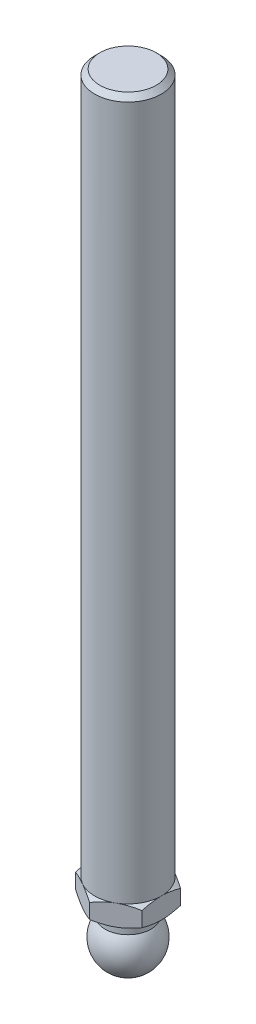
ISO-10303-21;
HEADER;
FILE_DESCRIPTION(('STEP AP214'),'2;1');
FILE_NAME('part.step','',(''),(''),'','','');
FILE_SCHEMA(('AUTOMOTIVE_DESIGN { 1 0 10303 214 1 1 1 1 }'));
ENDSEC;
DATA;
#1=APPLICATION_CONTEXT('core data for automotive mechanical design processes');
#2=APPLICATION_PROTOCOL_DEFINITION('international standard','automotive_design',2000,#1);
#3=PRODUCT_CONTEXT('',#1,'mechanical');
#4=PRODUCT('Part','Part','',(#3));
#5=PRODUCT_RELATED_PRODUCT_CATEGORY('part','',(#4));
#6=PRODUCT_DEFINITION_FORMATION('','',#4);
#7=PRODUCT_DEFINITION_CONTEXT('part definition',#1,'design');
#8=PRODUCT_DEFINITION('design','',#6,#7);
#9=PRODUCT_DEFINITION_SHAPE('','',#8);
#10=(LENGTH_UNIT() NAMED_UNIT(*) SI_UNIT(.MILLI.,.METRE.));
#11=(NAMED_UNIT(*) PLANE_ANGLE_UNIT() SI_UNIT($,.RADIAN.));
#12=(NAMED_UNIT(*) SI_UNIT($,.STERADIAN.) SOLID_ANGLE_UNIT());
#13=UNCERTAINTY_MEASURE_WITH_UNIT(LENGTH_MEASURE(1.E-05),#10,'distance_accuracy_value','');
#14=(GEOMETRIC_REPRESENTATION_CONTEXT(3) GLOBAL_UNCERTAINTY_ASSIGNED_CONTEXT((#13)) GLOBAL_UNIT_ASSIGNED_CONTEXT((#10,
#11,#12)) REPRESENTATION_CONTEXT('',''));
#15=CARTESIAN_POINT('',(0.,0.,0.));
#16=DIRECTION('',(0.,0.,1.));
#17=DIRECTION('',(1.,0.,0.));
#18=AXIS2_PLACEMENT_3D('',#15,#16,#17);
#19=CARTESIAN_POINT('',(0.,7.,0.));
#20=DIRECTION('',(0.,-1.,0.));
#21=DIRECTION('',(-1.,0.,0.));
#22=AXIS2_PLACEMENT_3D('',#19,#20,#21);
#23=SPHERICAL_SURFACE('',#22,7.);
#24=CARTESIAN_POINT('',(-9.71445146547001E-13,0.,0.));
#25=VERTEX_POINT('',#24);
#26=VERTEX_LOOP('',#25);
#27=FACE_BOUND('',#26,.T.);
#28=CARTESIAN_POINT('',(0.,11.3301270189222,0.));
#29=DIRECTION('',(0.,-1.,0.));
#30=DIRECTION('',(0.,0.,-1.));
#31=AXIS2_PLACEMENT_3D('',#28,#29,#30);
#32=CIRCLE('',#31,5.5);
#33=CARTESIAN_POINT('',(0.,11.3301270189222,-5.5));
#34=VERTEX_POINT('',#33);
#35=EDGE_CURVE('E10',#34,#34,#32,.T.);
#36=ORIENTED_EDGE('',*,*,#35,.T.);
#37=EDGE_LOOP('',(#36));
#38=FACE_BOUND('',#37,.T.);
#39=ADVANCED_FACE('F15',(#27,#38),#23,.T.);
#40=CARTESIAN_POINT('',(0.,0.,0.));
#41=DIRECTION('',(0.,-1.,0.));
#42=DIRECTION('',(0.,0.,-1.));
#43=AXIS2_PLACEMENT_3D('',#40,#41,#42);
#44=CYLINDRICAL_SURFACE('',#43,5.5);
#45=ORIENTED_EDGE('',*,*,#35,.F.);
#46=EDGE_LOOP('',(#45));
#47=FACE_BOUND('',#46,.T.);
#48=CARTESIAN_POINT('',(0.,14.5,0.));
#49=DIRECTION('',(0.,-1.,0.));
#50=DIRECTION('',(0.,0.,-1.));
#51=AXIS2_PLACEMENT_3D('',#48,#49,#50);
#52=CIRCLE('',#51,5.5);
#53=CARTESIAN_POINT('',(0.,14.5,-5.5));
#54=VERTEX_POINT('',#53);
#55=EDGE_CURVE('E147',#54,#54,#52,.T.);
#56=ORIENTED_EDGE('',*,*,#55,.T.);
#57=EDGE_LOOP('',(#56));
#58=FACE_BOUND('',#57,.T.);
#59=ADVANCED_FACE('F252',(#47,#58),#44,.T.);
#60=CARTESIAN_POINT('',(8.,14.5,0.));
#61=DIRECTION('',(0.,1.,0.));
#62=DIRECTION('',(0.,0.,1.));
#63=AXIS2_PLACEMENT_3D('',#60,#61,#62);
#64=PLANE('',#63);
#65=ORIENTED_EDGE('',*,*,#55,.F.);
#66=EDGE_LOOP('',(#65));
#67=FACE_BOUND('',#66,.T.);
#68=CARTESIAN_POINT('',(0.,14.5,0.));
#69=DIRECTION('',(0.,-1.,0.));
#70=DIRECTION('',(0.,0.,-1.));
#71=AXIS2_PLACEMENT_3D('',#68,#69,#70);
#72=CIRCLE('',#71,8.);
#73=CARTESIAN_POINT('',(4.,14.5,-6.92820323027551));
#74=VERTEX_POINT('',#73);
#75=CARTESIAN_POINT('',(8.,14.5,0.));
#76=VERTEX_POINT('',#75);
#77=EDGE_CURVE('E146',#74,#76,#72,.T.);
#78=ORIENTED_EDGE('',*,*,#77,.T.);
#79=CARTESIAN_POINT('',(4.,14.5,6.92820323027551));
#80=VERTEX_POINT('',#79);
#81=EDGE_CURVE('E142',#76,#80,#72,.T.);
#82=ORIENTED_EDGE('',*,*,#81,.T.);
#83=CARTESIAN_POINT('',(-4.,14.5,6.92820323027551));
#84=VERTEX_POINT('',#83);
#85=EDGE_CURVE('E145',#80,#84,#72,.T.);
#86=ORIENTED_EDGE('',*,*,#85,.T.);
#87=CARTESIAN_POINT('',(-8.,14.5,0.));
#88=VERTEX_POINT('',#87);
#89=EDGE_CURVE('E213',#84,#88,#72,.T.);
#90=ORIENTED_EDGE('',*,*,#89,.T.);
#91=CARTESIAN_POINT('',(-4.,14.5,-6.92820323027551));
#92=VERTEX_POINT('',#91);
#93=EDGE_CURVE('E216',#88,#92,#72,.T.);
#94=ORIENTED_EDGE('',*,*,#93,.T.);
#95=EDGE_CURVE('E221',#92,#74,#72,.T.);
#96=ORIENTED_EDGE('',*,*,#95,.T.);
#97=EDGE_LOOP('',(#78,#82,#86,#90,#94,#96));
#98=FACE_BOUND('',#97,.T.);
#99=ADVANCED_FACE('F223',(#67,#98),#64,.F.);
#100=CARTESIAN_POINT('',(0.,17.,0.));
#101=DIRECTION('',(0.,1.,0.));
#102=DIRECTION('',(0.,0.,1.));
#103=AXIS2_PLACEMENT_3D('',#100,#101,#102);
#104=CONICAL_SURFACE('',#103,12.3301270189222,1.0471975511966);
#105=CARTESIAN_POINT('',(-8.,19.285548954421,-14.1889203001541));
#106=CARTESIAN_POINT('',(-8.,19.1157216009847,-13.851186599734));
#107=CARTESIAN_POINT('',(-8.,18.9470198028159,-13.5128811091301));
#108=CARTESIAN_POINT('',(-8.,18.6124136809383,-12.8348638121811));
#109=CARTESIAN_POINT('',(-8.,18.446509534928,-12.4951519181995));
#110=CARTESIAN_POINT('',(-8.,18.1177477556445,-11.8134403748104));
#111=CARTESIAN_POINT('',(-8.,17.9548966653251,-11.4714375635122));
#112=CARTESIAN_POINT('',(-8.,17.6333333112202,-10.7854960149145));
#113=CARTESIAN_POINT('',(-8.,17.4746209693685,-10.4415573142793));
#114=CARTESIAN_POINT('',(-8.,17.1550497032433,-9.7353527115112));
#115=CARTESIAN_POINT('',(-8.,16.9944328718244,-9.37297690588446));
#116=CARTESIAN_POINT('',(-8.,16.680226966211,-8.64516064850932));
#117=CARTESIAN_POINT('',(-8.,16.5266382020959,-8.27972006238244));
#118=CARTESIAN_POINT('',(-8.,16.2285062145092,-7.54540420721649));
#119=CARTESIAN_POINT('',(-8.,16.0839575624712,-7.17653115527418));
#120=CARTESIAN_POINT('',(-8.,15.8063691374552,-6.43449862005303));
#121=CARTESIAN_POINT('',(-8.,15.6733281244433,-6.06133960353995));
#122=CARTESIAN_POINT('',(-8.,15.394180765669,-5.22677195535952));
#123=CARTESIAN_POINT('',(-8.,15.2517108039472,-4.7641292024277));
#124=CARTESIAN_POINT('',(-8.,14.9966536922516,-3.83044032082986));
#125=CARTESIAN_POINT('',(-8.,14.884064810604,-3.35939468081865));
#126=CARTESIAN_POINT('',(-8.,14.7453718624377,-2.65118427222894));
#127=CARTESIAN_POINT('',(-8.,14.7044045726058,-2.41690742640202));
#128=CARTESIAN_POINT('',(-8.,14.6329876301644,-1.94676929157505));
#129=CARTESIAN_POINT('',(-8.,14.6025364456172,-1.7109082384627));
#130=CARTESIAN_POINT('',(-8.,14.5530553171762,-1.23805721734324));
#131=CARTESIAN_POINT('',(-8.,14.5340217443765,-1.00106763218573));
#132=CARTESIAN_POINT('',(-8.,14.5079793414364,-0.52642336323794));
#133=CARTESIAN_POINT('',(-8.,14.500970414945,-0.288768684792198));
#134=CARTESIAN_POINT('',(-8.,14.4992116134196,0.188309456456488));
#135=CARTESIAN_POINT('',(-8.,14.5045509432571,0.427733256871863));
#136=CARTESIAN_POINT('',(-8.,14.5274871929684,0.905988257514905));
#137=CARTESIAN_POINT('',(-8.,14.5450842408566,1.1448194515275));
#138=CARTESIAN_POINT('',(-8.,14.5919591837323,1.62141631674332));
#139=CARTESIAN_POINT('',(-8.,14.6212415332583,1.85918154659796));
#140=CARTESIAN_POINT('',(-8.,14.6905925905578,2.33311174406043));
#141=CARTESIAN_POINT('',(-8.,14.7306614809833,2.56927668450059));
#142=CARTESIAN_POINT('',(-8.,14.8670437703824,3.28330816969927));
#143=CARTESIAN_POINT('',(-8.,14.9786420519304,3.75830022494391));
#144=CARTESIAN_POINT('',(-8.,15.169124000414,4.46428489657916));
#145=CARTESIAN_POINT('',(-8.,15.2364734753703,4.69855285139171));
#146=CARTESIAN_POINT('',(-8.,15.3778224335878,5.16507806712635));
#147=CARTESIAN_POINT('',(-8.,15.4518216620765,5.3973354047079));
#148=CARTESIAN_POINT('',(-8.,15.654376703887,6.0070580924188));
#149=CARTESIAN_POINT('',(-8.,15.7876997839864,6.38293491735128));
#150=CARTESIAN_POINT('',(-8.,16.0661205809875,7.13030495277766));
#151=CARTESIAN_POINT('',(-8.,16.2112196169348,7.50179766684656));
#152=CARTESIAN_POINT('',(-8.,16.5106611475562,8.2412884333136));
#153=CARTESIAN_POINT('',(-8.,16.6650093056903,8.60928418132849));
#154=CARTESIAN_POINT('',(-8.,16.9808780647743,9.34215095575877));
#155=CARTESIAN_POINT('',(-8.,17.1423983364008,9.7070221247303));
#156=CARTESIAN_POINT('',(-8.,17.4637771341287,10.4179250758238));
#157=CARTESIAN_POINT('',(-8.,17.6233869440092,10.7640696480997));
#158=CARTESIAN_POINT('',(-8.,17.9468132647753,11.4543922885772));
#159=CARTESIAN_POINT('',(-8.,18.1106298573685,11.7985703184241));
#160=CARTESIAN_POINT('',(-8.,18.441361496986,12.4845836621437));
#161=CARTESIAN_POINT('',(-8.,18.6082696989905,12.8264222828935));
#162=CARTESIAN_POINT('',(-8.,18.9449220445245,13.5086735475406));
#163=CARTESIAN_POINT('',(-8.,19.1146660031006,13.8490862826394));
#164=CARTESIAN_POINT('',(-8.,19.285548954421,14.1889203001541));
#165=B_SPLINE_CURVE_WITH_KNOTS('',3,(#105,#106,#107,#108,#109,#110,#111,#112,#113,#114,#115,
#116,#117,#118,#119,#120,#121,#122,#123,#124,#125,#126,#127,#128,#129,#130,#131,#132,#133,#134,
#135,#136,#137,#138,#139,#140,#141,#142,#143,#144,#145,#146,#147,#148,#149,#150,#151,#152,#153,
#154,#155,#156,#157,#158,#159,#160,#161,#162,#163,#164),.UNSPECIFIED.,.F.,.F.,(4,2,2,2,2,2,2,2,
2,2,2,2,2,2,2,2,2,2,2,2,2,2,2,2,2,2,2,2,2,4),(0.,1.13409047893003,2.2682527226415,
3.40461779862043,4.54096142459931,5.7300307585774,6.91915250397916,8.1075531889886,
9.29582565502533,10.7473798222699,12.1988498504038,12.9121466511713,13.6253394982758,
14.3383055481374,15.0512658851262,15.7693927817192,16.4875271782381,17.2059355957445,
17.9243561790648,19.3864869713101,20.1177019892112,20.8488890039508,22.0450800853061,
23.2414053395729,24.4384707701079,25.6354812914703,26.7789606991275,27.9224623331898,
29.063679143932,30.2048218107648),.UNSPECIFIED.);
#166=CARTESIAN_POINT('',(-8.,15.2145311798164,4.61880215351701));
#167=VERTEX_POINT('',#166);
#168=EDGE_CURVE('E158',#88,#167,#165,.T.);
#169=ORIENTED_EDGE('',*,*,#168,.F.);
#170=ORIENTED_EDGE('',*,*,#89,.F.);
#171=CARTESIAN_POINT('',(-8.0002,15.214597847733,4.61868668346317));
#172=CARTESIAN_POINT('',(-7.82435121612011,15.1559907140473,4.7202130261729));
#173=CARTESIAN_POINT('',(-7.64784680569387,15.1000434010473,4.82211789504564));
#174=CARTESIAN_POINT('',(-7.29340453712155,14.9942010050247,5.02675523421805));
#175=CARTESIAN_POINT('',(-7.11546609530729,14.9443085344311,5.1294880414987));
#176=CARTESIAN_POINT('',(-6.57880176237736,14.8046927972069,5.43933133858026));
#177=CARTESIAN_POINT('',(-6.21795741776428,14.7252811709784,5.64766491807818));
#178=CARTESIAN_POINT('',(-5.67796082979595,14.6321616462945,5.95943209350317));
#179=CARTESIAN_POINT('',(-5.50042181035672,14.6056345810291,6.06193429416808));
#180=CARTESIAN_POINT('',(-5.1445408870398,14.5611531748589,6.26740224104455));
#181=CARTESIAN_POINT('',(-4.96619905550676,14.5431980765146,6.37036794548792));
#182=CARTESIAN_POINT('',(-4.60920831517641,14.5163156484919,6.57647664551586));
#183=CARTESIAN_POINT('',(-4.4305599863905,14.5073780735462,6.67961930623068));
#184=CARTESIAN_POINT('',(-4.07309829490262,14.4987223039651,6.88599991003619));
#185=CARTESIAN_POINT('',(-3.89428493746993,14.4990038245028,6.98923785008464));
#186=CARTESIAN_POINT('',(-3.55998663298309,14.5081450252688,7.18224506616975));
#187=CARTESIAN_POINT('',(-3.40447809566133,14.5158896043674,7.27202796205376));
#188=CARTESIAN_POINT('',(-3.09382523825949,14.5382011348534,7.45138347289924));
#189=CARTESIAN_POINT('',(-2.93868094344,14.5527685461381,7.54095607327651));
#190=CARTESIAN_POINT('',(-2.47384868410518,14.6063606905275,7.80932710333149));
#191=CARTESIAN_POINT('',(-2.16498351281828,14.6552686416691,7.98765049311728));
#192=CARTESIAN_POINT('',(-1.5439767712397,14.7775394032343,8.34618890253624));
#193=CARTESIAN_POINT('',(-1.23191445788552,14.851420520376,8.52635816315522));
#194=CARTESIAN_POINT('',(-0.612443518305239,15.019100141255,8.88400987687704));
#195=CARTESIAN_POINT('',(-0.305026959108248,15.1128592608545,9.06149691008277));
#196=CARTESIAN_POINT('',(0.000200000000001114,15.214597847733,9.23771977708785));
#197=B_SPLINE_CURVE_WITH_KNOTS('',3,(#171,#172,#173,#174,#175,#176,#177,#178,#179,#180,#181,
#182,#183,#184,#185,#186,#187,#188,#189,#190,#191,#192,#193,#194,#195,#196),.UNSPECIFIED.,.F.,
.F.,(4,2,2,2,2,2,2,2,2,2,2,2,4),(0.,0.633973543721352,1.26821965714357,2.53934712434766,
3.1593434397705,3.77928496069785,4.39852133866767,5.01773858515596,5.5568023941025,
6.09590254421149,7.17487077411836,8.27776850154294,9.37850115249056),.UNSPECIFIED.);
#198=EDGE_CURVE('E121',#167,#84,#197,.T.);
#199=ORIENTED_EDGE('',*,*,#198,.F.);
#200=EDGE_LOOP('',(#169,#170,#199));
#201=FACE_BOUND('',#200,.T.);
#202=ADVANCED_FACE('F211',(#201),#104,.T.);
#203=CARTESIAN_POINT('',(0.0002,15.214597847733,-9.23771977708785));
#204=CARTESIAN_POINT('',(-0.175648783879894,15.1559907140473,-9.13619343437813));
#205=CARTESIAN_POINT('',(-0.352153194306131,15.1000434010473,-9.03428856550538));
#206=CARTESIAN_POINT('',(-0.706595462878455,14.9942010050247,-8.82965122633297));
#207=CARTESIAN_POINT('',(-0.884533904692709,14.9443085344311,-8.72691841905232));
#208=CARTESIAN_POINT('',(-1.42119823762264,14.8046927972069,-8.41707512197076));
#209=CARTESIAN_POINT('',(-1.78204258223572,14.7252811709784,-8.20874154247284));
#210=CARTESIAN_POINT('',(-2.32203917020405,14.6321616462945,-7.89697436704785));
#211=CARTESIAN_POINT('',(-2.49957818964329,14.6056345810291,-7.79447216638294));
#212=CARTESIAN_POINT('',(-2.8554591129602,14.5611531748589,-7.58900421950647));
#213=CARTESIAN_POINT('',(-3.03380094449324,14.5431980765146,-7.4860385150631));
#214=CARTESIAN_POINT('',(-3.39079168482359,14.5163156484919,-7.27992981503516));
#215=CARTESIAN_POINT('',(-3.5694400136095,14.5073780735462,-7.17678715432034));
#216=CARTESIAN_POINT('',(-3.92690170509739,14.4987223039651,-6.97040655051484));
#217=CARTESIAN_POINT('',(-4.10571506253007,14.4990038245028,-6.86716861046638));
#218=CARTESIAN_POINT('',(-4.44001336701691,14.5081450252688,-6.67416139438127));
#219=CARTESIAN_POINT('',(-4.59552190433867,14.5158896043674,-6.58437849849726));
#220=CARTESIAN_POINT('',(-4.90617476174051,14.5382011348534,-6.40502298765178));
#221=CARTESIAN_POINT('',(-5.06131905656,14.5527685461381,-6.31545038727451));
#222=CARTESIAN_POINT('',(-5.52615131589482,14.6063606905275,-6.04707935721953));
#223=CARTESIAN_POINT('',(-5.83501648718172,14.6552686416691,-5.86875596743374));
#224=CARTESIAN_POINT('',(-6.4560232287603,14.7775394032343,-5.51021755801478));
#225=CARTESIAN_POINT('',(-6.76808554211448,14.851420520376,-5.3300482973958));
#226=CARTESIAN_POINT('',(-7.38755648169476,15.019100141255,-4.97239658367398));
#227=CARTESIAN_POINT('',(-7.69497304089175,15.1128592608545,-4.79490955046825));
#228=CARTESIAN_POINT('',(-8.0002,15.214597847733,-4.61868668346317));
#229=B_SPLINE_CURVE_WITH_KNOTS('',3,(#203,#204,#205,#206,#207,#208,#209,#210,#211,#212,#213,
#214,#215,#216,#217,#218,#219,#220,#221,#222,#223,#224,#225,#226,#227,#228),.UNSPECIFIED.,.F.,
.F.,(4,2,2,2,2,2,2,2,2,2,2,2,4),(0.,0.633973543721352,1.26821965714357,2.53934712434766,
3.1593434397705,3.77928496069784,4.39852133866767,5.01773858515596,5.5568023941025,
6.09590254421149,7.17487077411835,8.27776850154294,9.37850115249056),.UNSPECIFIED.);
#230=CARTESIAN_POINT('',(-8.,15.2145311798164,-4.61880215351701));
#231=VERTEX_POINT('',#230);
#232=EDGE_CURVE('E183',#92,#231,#229,.T.);
#233=ORIENTED_EDGE('',*,*,#232,.F.);
#234=ORIENTED_EDGE('',*,*,#93,.F.);
#235=EDGE_CURVE('E157',#231,#88,#165,.T.);
#236=ORIENTED_EDGE('',*,*,#235,.F.);
#237=EDGE_LOOP('',(#233,#234,#236));
#238=FACE_BOUND('',#237,.T.);
#239=ADVANCED_FACE('F217',(#238),#104,.T.);
#240=CARTESIAN_POINT('',(8.0002,15.214597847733,-4.61868668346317));
#241=CARTESIAN_POINT('',(7.82435121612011,15.1559907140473,-4.7202130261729));
#242=CARTESIAN_POINT('',(7.64784680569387,15.1000434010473,-4.82211789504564));
#243=CARTESIAN_POINT('',(7.29340453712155,14.9942010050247,-5.02675523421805));
#244=CARTESIAN_POINT('',(7.11546609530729,14.9443085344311,-5.1294880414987));
#245=CARTESIAN_POINT('',(6.57880176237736,14.8046927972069,-5.43933133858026));
#246=CARTESIAN_POINT('',(6.21795741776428,14.7252811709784,-5.64766491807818));
#247=CARTESIAN_POINT('',(5.67796082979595,14.6321616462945,-5.95943209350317));
#248=CARTESIAN_POINT('',(5.50042181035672,14.6056345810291,-6.06193429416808));
#249=CARTESIAN_POINT('',(5.1445408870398,14.5611531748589,-6.26740224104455));
#250=CARTESIAN_POINT('',(4.96619905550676,14.5431980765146,-6.37036794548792));
#251=CARTESIAN_POINT('',(4.60920831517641,14.5163156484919,-6.57647664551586));
#252=CARTESIAN_POINT('',(4.4305599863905,14.5073780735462,-6.67961930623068));
#253=CARTESIAN_POINT('',(4.07309829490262,14.4987223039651,-6.88599991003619));
#254=CARTESIAN_POINT('',(3.89428493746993,14.4990038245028,-6.98923785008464));
#255=CARTESIAN_POINT('',(3.55998663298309,14.5081450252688,-7.18224506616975));
#256=CARTESIAN_POINT('',(3.40447809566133,14.5158896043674,-7.27202796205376));
#257=CARTESIAN_POINT('',(3.09382523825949,14.5382011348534,-7.45138347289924));
#258=CARTESIAN_POINT('',(2.93868094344,14.5527685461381,-7.54095607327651));
#259=CARTESIAN_POINT('',(2.47384868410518,14.6063606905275,-7.80932710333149));
#260=CARTESIAN_POINT('',(2.16498351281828,14.6552686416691,-7.98765049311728));
#261=CARTESIAN_POINT('',(1.5439767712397,14.7775394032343,-8.34618890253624));
#262=CARTESIAN_POINT('',(1.23191445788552,14.851420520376,-8.52635816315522));
#263=CARTESIAN_POINT('',(0.612443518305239,15.019100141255,-8.88400987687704));
#264=CARTESIAN_POINT('',(0.305026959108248,15.1128592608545,-9.06149691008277));
#265=CARTESIAN_POINT('',(-0.000200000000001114,15.214597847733,-9.23771977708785));
#266=B_SPLINE_CURVE_WITH_KNOTS('',3,(#240,#241,#242,#243,#244,#245,#246,#247,#248,#249,#250,
#251,#252,#253,#254,#255,#256,#257,#258,#259,#260,#261,#262,#263,#264,#265),.UNSPECIFIED.,.F.,
.F.,(4,2,2,2,2,2,2,2,2,2,2,2,4),(0.,0.633973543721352,1.26821965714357,2.53934712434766,
3.1593434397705,3.77928496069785,4.39852133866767,5.01773858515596,5.5568023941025,
6.09590254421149,7.17487077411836,8.27776850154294,9.37850115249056),.UNSPECIFIED.);
#267=CARTESIAN_POINT('',(0.,15.2145311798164,-9.23760430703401));
#268=VERTEX_POINT('',#267);
#269=EDGE_CURVE('E286',#74,#268,#266,.T.);
#270=ORIENTED_EDGE('',*,*,#269,.F.);
#271=ORIENTED_EDGE('',*,*,#95,.F.);
#272=EDGE_CURVE('E194',#268,#92,#229,.T.);
#273=ORIENTED_EDGE('',*,*,#272,.F.);
#274=EDGE_LOOP('',(#270,#271,#273));
#275=FACE_BOUND('',#274,.T.);
#276=ADVANCED_FACE('F306',(#275),#104,.T.);
#277=CARTESIAN_POINT('',(-0.0002,15.214597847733,9.23771977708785));
#278=CARTESIAN_POINT('',(0.175648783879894,15.1559907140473,9.13619343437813));
#279=CARTESIAN_POINT('',(0.352153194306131,15.1000434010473,9.03428856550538));
#280=CARTESIAN_POINT('',(0.706595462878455,14.9942010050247,8.82965122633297));
#281=CARTESIAN_POINT('',(0.884533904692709,14.9443085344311,8.72691841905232));
#282=CARTESIAN_POINT('',(1.42119823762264,14.8046927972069,8.41707512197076));
#283=CARTESIAN_POINT('',(1.78204258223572,14.7252811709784,8.20874154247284));
#284=CARTESIAN_POINT('',(2.32203917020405,14.6321616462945,7.89697436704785));
#285=CARTESIAN_POINT('',(2.49957818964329,14.6056345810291,7.79447216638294));
#286=CARTESIAN_POINT('',(2.8554591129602,14.5611531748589,7.58900421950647));
#287=CARTESIAN_POINT('',(3.03380094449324,14.5431980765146,7.4860385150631));
#288=CARTESIAN_POINT('',(3.39079168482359,14.5163156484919,7.27992981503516));
#289=CARTESIAN_POINT('',(3.5694400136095,14.5073780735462,7.17678715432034));
#290=CARTESIAN_POINT('',(3.92690170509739,14.4987223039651,6.97040655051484));
#291=CARTESIAN_POINT('',(4.10571506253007,14.4990038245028,6.86716861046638));
#292=CARTESIAN_POINT('',(4.44001336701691,14.5081450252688,6.67416139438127));
#293=CARTESIAN_POINT('',(4.59552190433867,14.5158896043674,6.58437849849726));
#294=CARTESIAN_POINT('',(4.90617476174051,14.5382011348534,6.40502298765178));
#295=CARTESIAN_POINT('',(5.06131905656,14.5527685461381,6.31545038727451));
#296=CARTESIAN_POINT('',(5.52615131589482,14.6063606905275,6.04707935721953));
#297=CARTESIAN_POINT('',(5.83501648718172,14.6552686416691,5.86875596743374));
#298=CARTESIAN_POINT('',(6.4560232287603,14.7775394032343,5.51021755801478));
#299=CARTESIAN_POINT('',(6.76808554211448,14.851420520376,5.3300482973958));
#300=CARTESIAN_POINT('',(7.38755648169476,15.019100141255,4.97239658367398));
#301=CARTESIAN_POINT('',(7.69497304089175,15.1128592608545,4.79490955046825));
#302=CARTESIAN_POINT('',(8.0002,15.214597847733,4.61868668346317));
#303=B_SPLINE_CURVE_WITH_KNOTS('',3,(#277,#278,#279,#280,#281,#282,#283,#284,#285,#286,#287,
#288,#289,#290,#291,#292,#293,#294,#295,#296,#297,#298,#299,#300,#301,#302),.UNSPECIFIED.,.F.,
.F.,(4,2,2,2,2,2,2,2,2,2,2,2,4),(0.,0.633973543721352,1.26821965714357,2.53934712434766,
3.1593434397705,3.77928496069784,4.39852133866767,5.01773858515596,5.5568023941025,
6.09590254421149,7.17487077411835,8.27776850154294,9.37850115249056),.UNSPECIFIED.);
#304=CARTESIAN_POINT('',(0.,15.2145311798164,9.23760430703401));
#305=VERTEX_POINT('',#304);
#306=EDGE_CURVE('E229',#305,#80,#303,.T.);
#307=ORIENTED_EDGE('',*,*,#306,.F.);
#308=EDGE_CURVE('E32',#84,#305,#197,.T.);
#309=ORIENTED_EDGE('',*,*,#308,.F.);
#310=ORIENTED_EDGE('',*,*,#85,.F.);
#311=EDGE_LOOP('',(#307,#309,#310));
#312=FACE_BOUND('',#311,.T.);
#313=ADVANCED_FACE('F228',(#312),#104,.T.);
#314=CARTESIAN_POINT('',(8.,15.2145311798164,-4.61880215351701));
#315=VERTEX_POINT('',#314);
#316=EDGE_CURVE('E291',#315,#74,#266,.T.);
#317=ORIENTED_EDGE('',*,*,#316,.F.);
#318=CARTESIAN_POINT('',(8.,19.285548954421,14.1889203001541));
#319=CARTESIAN_POINT('',(8.,19.1157216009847,13.851186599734));
#320=CARTESIAN_POINT('',(8.,18.9470198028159,13.5128811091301));
#321=CARTESIAN_POINT('',(8.,18.6124136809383,12.8348638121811));
#322=CARTESIAN_POINT('',(8.,18.446509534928,12.4951519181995));
#323=CARTESIAN_POINT('',(8.,18.1177477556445,11.8134403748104));
#324=CARTESIAN_POINT('',(8.,17.9548966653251,11.4714375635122));
#325=CARTESIAN_POINT('',(8.,17.6333333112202,10.7854960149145));
#326=CARTESIAN_POINT('',(8.,17.4746209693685,10.4415573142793));
#327=CARTESIAN_POINT('',(8.,17.1550497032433,9.7353527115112));
#328=CARTESIAN_POINT('',(8.,16.9944328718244,9.37297690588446));
#329=CARTESIAN_POINT('',(8.,16.680226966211,8.64516064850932));
#330=CARTESIAN_POINT('',(8.,16.5266382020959,8.27972006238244));
#331=CARTESIAN_POINT('',(8.,16.2285062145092,7.54540420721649));
#332=CARTESIAN_POINT('',(8.,16.0839575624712,7.17653115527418));
#333=CARTESIAN_POINT('',(8.,15.8063691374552,6.43449862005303));
#334=CARTESIAN_POINT('',(8.,15.6733281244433,6.06133960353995));
#335=CARTESIAN_POINT('',(8.,15.394180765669,5.22677195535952));
#336=CARTESIAN_POINT('',(8.,15.2517108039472,4.7641292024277));
#337=CARTESIAN_POINT('',(8.,14.9966536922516,3.83044032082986));
#338=CARTESIAN_POINT('',(8.,14.884064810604,3.35939468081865));
#339=CARTESIAN_POINT('',(8.,14.7453718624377,2.65118427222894));
#340=CARTESIAN_POINT('',(8.,14.7044045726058,2.41690742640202));
#341=CARTESIAN_POINT('',(8.,14.6329876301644,1.94676929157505));
#342=CARTESIAN_POINT('',(8.,14.6025364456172,1.7109082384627));
#343=CARTESIAN_POINT('',(8.,14.5530553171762,1.23805721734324));
#344=CARTESIAN_POINT('',(8.,14.5340217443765,1.00106763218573));
#345=CARTESIAN_POINT('',(8.,14.5079793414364,0.52642336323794));
#346=CARTESIAN_POINT('',(8.,14.500970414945,0.288768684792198));
#347=CARTESIAN_POINT('',(8.,14.4992116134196,-0.188309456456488));
#348=CARTESIAN_POINT('',(8.,14.5045509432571,-0.427733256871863));
#349=CARTESIAN_POINT('',(8.,14.5274871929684,-0.905988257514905));
#350=CARTESIAN_POINT('',(8.,14.5450842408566,-1.1448194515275));
#351=CARTESIAN_POINT('',(8.,14.5919591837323,-1.62141631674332));
#352=CARTESIAN_POINT('',(8.,14.6212415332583,-1.85918154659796));
#353=CARTESIAN_POINT('',(8.,14.6905925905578,-2.33311174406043));
#354=CARTESIAN_POINT('',(8.,14.7306614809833,-2.56927668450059));
#355=CARTESIAN_POINT('',(8.,14.8670437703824,-3.28330816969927));
#356=CARTESIAN_POINT('',(8.,14.9786420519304,-3.75830022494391));
#357=CARTESIAN_POINT('',(8.,15.169124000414,-4.46428489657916));
#358=CARTESIAN_POINT('',(8.,15.2364734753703,-4.69855285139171));
#359=CARTESIAN_POINT('',(8.,15.3778224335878,-5.16507806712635));
#360=CARTESIAN_POINT('',(8.,15.4518216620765,-5.3973354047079));
#361=CARTESIAN_POINT('',(8.,15.654376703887,-6.0070580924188));
#362=CARTESIAN_POINT('',(8.,15.7876997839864,-6.38293491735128));
#363=CARTESIAN_POINT('',(8.,16.0661205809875,-7.13030495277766));
#364=CARTESIAN_POINT('',(8.,16.2112196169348,-7.50179766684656));
#365=CARTESIAN_POINT('',(8.,16.5106611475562,-8.2412884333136));
#366=CARTESIAN_POINT('',(8.,16.6650093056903,-8.60928418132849));
#367=CARTESIAN_POINT('',(8.,16.9808780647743,-9.34215095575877));
#368=CARTESIAN_POINT('',(8.,17.1423983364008,-9.7070221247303));
#369=CARTESIAN_POINT('',(8.,17.4637771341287,-10.4179250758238));
#370=CARTESIAN_POINT('',(8.,17.6233869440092,-10.7640696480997));
#371=CARTESIAN_POINT('',(8.,17.9468132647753,-11.4543922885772));
#372=CARTESIAN_POINT('',(8.,18.1106298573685,-11.7985703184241));
#373=CARTESIAN_POINT('',(8.,18.441361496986,-12.4845836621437));
#374=CARTESIAN_POINT('',(8.,18.6082696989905,-12.8264222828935));
#375=CARTESIAN_POINT('',(8.,18.9449220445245,-13.5086735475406));
#376=CARTESIAN_POINT('',(8.,19.1146660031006,-13.8490862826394));
#377=CARTESIAN_POINT('',(8.,19.285548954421,-14.1889203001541));
#378=B_SPLINE_CURVE_WITH_KNOTS('',3,(#318,#319,#320,#321,#322,#323,#324,#325,#326,#327,#328,
#329,#330,#331,#332,#333,#334,#335,#336,#337,#338,#339,#340,#341,#342,#343,#344,#345,#346,#347,
#348,#349,#350,#351,#352,#353,#354,#355,#356,#357,#358,#359,#360,#361,#362,#363,#364,#365,#366,
#367,#368,#369,#370,#371,#372,#373,#374,#375,#376,#377),.UNSPECIFIED.,.F.,.F.,(4,2,2,2,2,2,2,2,
2,2,2,2,2,2,2,2,2,2,2,2,2,2,2,2,2,2,2,2,2,4),(0.,1.13409047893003,2.2682527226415,
3.40461779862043,4.54096142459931,5.7300307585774,6.91915250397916,8.1075531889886,
9.29582565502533,10.7473798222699,12.1988498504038,12.9121466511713,13.6253394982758,
14.3383055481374,15.0512658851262,15.7693927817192,16.4875271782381,17.2059355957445,
17.9243561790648,19.3864869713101,20.1177019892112,20.8488890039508,22.0450800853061,
23.2414053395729,24.4384707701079,25.6354812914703,26.7789606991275,27.9224623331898,
29.063679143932,30.2048218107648),.UNSPECIFIED.);
#379=EDGE_CURVE('E272',#76,#315,#378,.T.);
#380=ORIENTED_EDGE('',*,*,#379,.F.);
#381=ORIENTED_EDGE('',*,*,#77,.F.);
#382=EDGE_LOOP('',(#317,#380,#381));
#383=FACE_BOUND('',#382,.T.);
#384=ADVANCED_FACE('F244',(#383),#104,.T.);
#385=CARTESIAN_POINT('',(8.,15.2145311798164,4.61880215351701));
#386=VERTEX_POINT('',#385);
#387=EDGE_CURVE('E278',#386,#76,#378,.T.);
#388=ORIENTED_EDGE('',*,*,#387,.F.);
#389=EDGE_CURVE('E112',#80,#386,#303,.T.);
#390=ORIENTED_EDGE('',*,*,#389,.F.);
#391=ORIENTED_EDGE('',*,*,#81,.F.);
#392=EDGE_LOOP('',(#388,#390,#391));
#393=FACE_BOUND('',#392,.T.);
#394=ADVANCED_FACE('F251',(#393),#104,.T.);
#395=CARTESIAN_POINT('',(-8.,14.3,4.61880215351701));
#396=DIRECTION('',(-0.5,0.,0.866025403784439));
#397=DIRECTION('',(0.866025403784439,0.,0.5));
#398=AXIS2_PLACEMENT_3D('',#395,#396,#397);
#399=PLANE('',#398);
#400=CARTESIAN_POINT('',(0.0002,18.7854021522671,9.23771977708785));
#401=CARTESIAN_POINT('',(-0.175648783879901,18.8440092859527,9.13619343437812));
#402=CARTESIAN_POINT('',(-0.352153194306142,18.8999565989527,9.03428856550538));
#403=CARTESIAN_POINT('',(-0.706595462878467,19.0057989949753,8.82965122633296));
#404=CARTESIAN_POINT('',(-0.884533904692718,19.0556914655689,8.72691841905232));
#405=CARTESIAN_POINT('',(-1.42119823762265,19.1953072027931,8.41707512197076));
#406=CARTESIAN_POINT('',(-1.78204258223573,19.2747188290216,8.20874154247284));
#407=CARTESIAN_POINT('',(-2.32203917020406,19.3678383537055,7.89697436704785));
#408=CARTESIAN_POINT('',(-2.49957818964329,19.3943654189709,7.79447216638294));
#409=CARTESIAN_POINT('',(-2.85545911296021,19.4388468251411,7.58900421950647));
#410=CARTESIAN_POINT('',(-3.03380094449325,19.4568019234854,7.4860385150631));
#411=CARTESIAN_POINT('',(-3.3907916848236,19.4836843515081,7.27992981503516));
#412=CARTESIAN_POINT('',(-3.56944001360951,19.4926219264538,7.17678715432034));
#413=CARTESIAN_POINT('',(-3.92690170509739,19.5012776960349,6.97040655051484));
#414=CARTESIAN_POINT('',(-4.10571506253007,19.5009961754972,6.86716861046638));
#415=CARTESIAN_POINT('',(-4.44001336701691,19.4918549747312,6.67416139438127));
#416=CARTESIAN_POINT('',(-4.59552190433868,19.4841103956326,6.58437849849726));
#417=CARTESIAN_POINT('',(-4.90617476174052,19.4617988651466,6.40502298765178));
#418=CARTESIAN_POINT('',(-5.06131905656,19.4472314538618,6.31545038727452));
#419=CARTESIAN_POINT('',(-5.52615131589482,19.3936393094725,6.04707935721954));
#420=CARTESIAN_POINT('',(-5.83501648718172,19.3447313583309,5.86875596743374));
#421=CARTESIAN_POINT('',(-6.4560232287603,19.2224605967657,5.51021755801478));
#422=CARTESIAN_POINT('',(-6.76808554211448,19.148579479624,5.33004829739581));
#423=CARTESIAN_POINT('',(-7.38755648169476,18.980899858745,4.97239658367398));
#424=CARTESIAN_POINT('',(-7.69497304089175,18.8871407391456,4.79490955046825));
#425=CARTESIAN_POINT('',(-8.0002,18.7854021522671,4.61868668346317));
#426=B_SPLINE_CURVE_WITH_KNOTS('',3,(#400,#401,#402,#403,#404,#405,#406,#407,#408,#409,#410,
#411,#412,#413,#414,#415,#416,#417,#418,#419,#420,#421,#422,#423,#424,#425),.UNSPECIFIED.,.F.,
.F.,(4,2,2,2,2,2,2,2,2,2,2,2,4),(0.,0.633973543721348,1.26821965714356,2.53934712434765,
3.15934343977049,3.77928496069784,4.39852133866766,5.01773858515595,5.55680239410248,
6.09590254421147,7.17487077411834,8.27776850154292,9.37850115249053),.UNSPECIFIED.);
#427=CARTESIAN_POINT('',(0.,18.7854688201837,9.23760430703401));
#428=VERTEX_POINT('',#427);
#429=CARTESIAN_POINT('',(-4.,19.5,6.92820323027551));
#430=VERTEX_POINT('',#429);
#431=EDGE_CURVE('E102',#428,#430,#426,.T.);
#432=ORIENTED_EDGE('',*,*,#431,.T.);
#433=CARTESIAN_POINT('',(-8.,18.7854688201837,4.61880215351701));
#434=VERTEX_POINT('',#433);
#435=EDGE_CURVE('E106',#430,#434,#426,.T.);
#436=ORIENTED_EDGE('',*,*,#435,.T.);
#437=DIRECTION('',(0.,1.,0.));
#438=VECTOR('',#437,1.);
#439=CARTESIAN_POINT('',(-8.,14.3,4.61880215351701));
#440=LINE('',#439,#438);
#441=EDGE_CURVE('E22',#167,#434,#440,.T.);
#442=ORIENTED_EDGE('',*,*,#441,.F.);
#443=ORIENTED_EDGE('',*,*,#198,.T.);
#444=ORIENTED_EDGE('',*,*,#308,.T.);
#445=DIRECTION('',(0.,1.,0.));
#446=VECTOR('',#445,1.);
#447=CARTESIAN_POINT('',(0.,14.3,9.23760430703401));
#448=LINE('',#447,#446);
#449=EDGE_CURVE('E108',#305,#428,#448,.T.);
#450=ORIENTED_EDGE('',*,*,#449,.T.);
#451=EDGE_LOOP('',(#432,#436,#442,#443,#444,#450));
#452=FACE_BOUND('',#451,.T.);
#453=ADVANCED_FACE('F104',(#452),#399,.T.);
#454=CARTESIAN_POINT('',(-8.,14.3,-4.61880215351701));
#455=DIRECTION('',(-1.,0.,0.));
#456=DIRECTION('',(0.,0.,1.));
#457=AXIS2_PLACEMENT_3D('',#454,#455,#456);
#458=PLANE('',#457);
#459=CARTESIAN_POINT('',(-8.,14.714451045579,14.1889203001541));
#460=CARTESIAN_POINT('',(-8.,14.8842783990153,13.851186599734));
#461=CARTESIAN_POINT('',(-8.,15.0529801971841,13.5128811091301));
#462=CARTESIAN_POINT('',(-8.,15.3875863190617,12.8348638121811));
#463=CARTESIAN_POINT('',(-8.,15.553490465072,12.4951519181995));
#464=CARTESIAN_POINT('',(-8.,15.8822522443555,11.8134403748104));
#465=CARTESIAN_POINT('',(-8.,16.0451033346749,11.4714375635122));
#466=CARTESIAN_POINT('',(-8.,16.3666666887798,10.7854960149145));
#467=CARTESIAN_POINT('',(-8.,16.5253790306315,10.4415573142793));
#468=CARTESIAN_POINT('',(-8.,16.8449502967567,9.73535271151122));
#469=CARTESIAN_POINT('',(-8.,17.0055671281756,9.37297690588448));
#470=CARTESIAN_POINT('',(-8.,17.3197730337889,8.64516064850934));
#471=CARTESIAN_POINT('',(-8.,17.4733617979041,8.27972006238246));
#472=CARTESIAN_POINT('',(-8.,17.7714937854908,7.54540420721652));
#473=CARTESIAN_POINT('',(-8.,17.9160424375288,7.1765311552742));
#474=CARTESIAN_POINT('',(-8.,18.1936308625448,6.43449862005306));
#475=CARTESIAN_POINT('',(-8.,18.3266718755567,6.06133960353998));
#476=CARTESIAN_POINT('',(-8.,18.605819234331,5.22677195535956));
#477=CARTESIAN_POINT('',(-8.,18.7482891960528,4.76412920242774));
#478=CARTESIAN_POINT('',(-8.,19.0033463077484,3.83044032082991));
#479=CARTESIAN_POINT('',(-8.,19.115935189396,3.3593946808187));
#480=CARTESIAN_POINT('',(-8.,19.2546281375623,2.651184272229));
#481=CARTESIAN_POINT('',(-8.,19.2955954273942,2.41690742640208));
#482=CARTESIAN_POINT('',(-8.,19.3670123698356,1.94676929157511));
#483=CARTESIAN_POINT('',(-8.,19.3974635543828,1.71090823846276));
#484=CARTESIAN_POINT('',(-8.,19.4469446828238,1.23805721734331));
#485=CARTESIAN_POINT('',(-8.,19.4659782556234,1.0010676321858));
#486=CARTESIAN_POINT('',(-8.,19.4920206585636,0.526423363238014));
#487=CARTESIAN_POINT('',(-8.,19.499029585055,0.288768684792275));
#488=CARTESIAN_POINT('',(-8.,19.5007883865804,-0.188309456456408));
#489=CARTESIAN_POINT('',(-8.,19.4954490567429,-0.427733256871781));
#490=CARTESIAN_POINT('',(-8.,19.4725128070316,-0.905988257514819));
#491=CARTESIAN_POINT('',(-8.,19.4549157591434,-1.14481945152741));
#492=CARTESIAN_POINT('',(-8.,19.4080408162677,-1.62141631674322));
#493=CARTESIAN_POINT('',(-8.,19.3787584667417,-1.85918154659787));
#494=CARTESIAN_POINT('',(-8.,19.3094074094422,-2.33311174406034));
#495=CARTESIAN_POINT('',(-8.,19.2693385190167,-2.56927668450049));
#496=CARTESIAN_POINT('',(-8.,19.1329562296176,-3.28330816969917));
#497=CARTESIAN_POINT('',(-8.,19.0213579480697,-3.75830022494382));
#498=CARTESIAN_POINT('',(-8.,18.830875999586,-4.46428489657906));
#499=CARTESIAN_POINT('',(-8.,18.7635265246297,-4.69855285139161));
#500=CARTESIAN_POINT('',(-8.,18.6221775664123,-5.16507806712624));
#501=CARTESIAN_POINT('',(-8.,18.5481783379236,-5.39733540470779));
#502=CARTESIAN_POINT('',(-8.,18.3456232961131,-6.00705809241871));
#503=CARTESIAN_POINT('',(-8.,18.2123002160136,-6.38293491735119));
#504=CARTESIAN_POINT('',(-8.,17.9338794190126,-7.13030495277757));
#505=CARTESIAN_POINT('',(-8.,17.7887803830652,-7.50179766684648));
#506=CARTESIAN_POINT('',(-8.,17.4893388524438,-8.24128843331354));
#507=CARTESIAN_POINT('',(-8.,17.3349906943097,-8.60928418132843));
#508=CARTESIAN_POINT('',(-8.,17.0191219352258,-9.34215095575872));
#509=CARTESIAN_POINT('',(-8.,16.8576016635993,-9.70702212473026));
#510=CARTESIAN_POINT('',(-8.,16.5362228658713,-10.4179250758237));
#511=CARTESIAN_POINT('',(-8.,16.3766130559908,-10.7640696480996));
#512=CARTESIAN_POINT('',(-8.,16.0531867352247,-11.4543922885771));
#513=CARTESIAN_POINT('',(-8.,15.8893701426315,-11.798570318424));
#514=CARTESIAN_POINT('',(-8.,15.558638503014,-12.4845836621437));
#515=CARTESIAN_POINT('',(-8.,15.3917303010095,-12.8264222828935));
#516=CARTESIAN_POINT('',(-8.,15.0550779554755,-13.5086735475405));
#517=CARTESIAN_POINT('',(-8.,14.8853339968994,-13.8490862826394));
#518=CARTESIAN_POINT('',(-8.,14.714451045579,-14.1889203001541));
#519=B_SPLINE_CURVE_WITH_KNOTS('',3,(#459,#460,#461,#462,#463,#464,#465,#466,#467,#468,#469,
#470,#471,#472,#473,#474,#475,#476,#477,#478,#479,#480,#481,#482,#483,#484,#485,#486,#487,#488,
#489,#490,#491,#492,#493,#494,#495,#496,#497,#498,#499,#500,#501,#502,#503,#504,#505,#506,#507,
#508,#509,#510,#511,#512,#513,#514,#515,#516,#517,#518),.UNSPECIFIED.,.F.,.F.,(4,2,2,2,2,2,2,2,
2,2,2,2,2,2,2,2,2,2,2,2,2,2,2,2,2,2,2,2,2,4),(0.,1.13409047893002,2.26825272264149,
3.40461779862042,4.5409614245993,5.73003075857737,6.91915250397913,8.10755318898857,
9.29582565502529,10.7473798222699,12.1988498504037,12.9121466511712,13.6253394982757,
14.3383055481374,15.0512658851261,15.7693927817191,16.487527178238,17.2059355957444,
17.9243561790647,19.38648697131,20.1177019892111,20.8488890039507,22.0450800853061,
23.2414053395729,24.4384707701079,25.6354812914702,26.7789606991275,27.9224623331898,
29.063679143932,30.2048218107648),.UNSPECIFIED.);
#520=CARTESIAN_POINT('',(-8.,19.5,0.));
#521=VERTEX_POINT('',#520);
#522=EDGE_CURVE('E120',#434,#521,#519,.T.);
#523=ORIENTED_EDGE('',*,*,#522,.T.);
#524=CARTESIAN_POINT('',(-8.,18.7854688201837,-4.61880215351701));
#525=VERTEX_POINT('',#524);
#526=EDGE_CURVE('E150',#521,#525,#519,.T.);
#527=ORIENTED_EDGE('',*,*,#526,.T.);
#528=DIRECTION('',(0.,1.,0.));
#529=VECTOR('',#528,1.);
#530=CARTESIAN_POINT('',(-8.,14.3,-4.61880215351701));
#531=LINE('',#530,#529);
#532=EDGE_CURVE('E204',#231,#525,#531,.T.);
#533=ORIENTED_EDGE('',*,*,#532,.F.);
#534=ORIENTED_EDGE('',*,*,#235,.T.);
#535=ORIENTED_EDGE('',*,*,#168,.T.);
#536=ORIENTED_EDGE('',*,*,#441,.T.);
#537=EDGE_LOOP('',(#523,#527,#533,#534,#535,#536));
#538=FACE_BOUND('',#537,.T.);
#539=ADVANCED_FACE('F167',(#538),#458,.T.);
#540=CARTESIAN_POINT('',(0.,14.3,-9.23760430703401));
#541=DIRECTION('',(-0.5,0.,-0.866025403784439));
#542=DIRECTION('',(-0.866025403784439,0.,0.5));
#543=AXIS2_PLACEMENT_3D('',#540,#541,#542);
#544=PLANE('',#543);
#545=CARTESIAN_POINT('',(-8.0002,18.7854021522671,-4.61868668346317));
#546=CARTESIAN_POINT('',(-7.8243512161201,18.8440092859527,-4.7202130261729));
#547=CARTESIAN_POINT('',(-7.64784680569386,18.8999565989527,-4.82211789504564));
#548=CARTESIAN_POINT('',(-7.29340453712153,19.0057989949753,-5.02675523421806));
#549=CARTESIAN_POINT('',(-7.11546609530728,19.0556914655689,-5.1294880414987));
#550=CARTESIAN_POINT('',(-6.57880176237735,19.1953072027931,-5.43933133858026));
#551=CARTESIAN_POINT('',(-6.21795741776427,19.2747188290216,-5.64766491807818));
#552=CARTESIAN_POINT('',(-5.67796082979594,19.3678383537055,-5.95943209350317));
#553=CARTESIAN_POINT('',(-5.50042181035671,19.3943654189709,-6.06193429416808));
#554=CARTESIAN_POINT('',(-5.14454088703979,19.4388468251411,-6.26740224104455));
#555=CARTESIAN_POINT('',(-4.96619905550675,19.4568019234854,-6.37036794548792));
#556=CARTESIAN_POINT('',(-4.6092083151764,19.4836843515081,-6.57647664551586));
#557=CARTESIAN_POINT('',(-4.43055998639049,19.4926219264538,-6.67961930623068));
#558=CARTESIAN_POINT('',(-4.07309829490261,19.5012776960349,-6.88599991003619));
#559=CARTESIAN_POINT('',(-3.89428493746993,19.5009961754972,-6.98923785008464));
#560=CARTESIAN_POINT('',(-3.55998663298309,19.4918549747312,-7.18224506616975));
#561=CARTESIAN_POINT('',(-3.40447809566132,19.4841103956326,-7.27202796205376));
#562=CARTESIAN_POINT('',(-3.09382523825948,19.4617988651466,-7.45138347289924));
#563=CARTESIAN_POINT('',(-2.93868094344,19.4472314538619,-7.54095607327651));
#564=CARTESIAN_POINT('',(-2.47384868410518,19.3936393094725,-7.80932710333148));
#565=CARTESIAN_POINT('',(-2.16498351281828,19.3447313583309,-7.98765049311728));
#566=CARTESIAN_POINT('',(-1.5439767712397,19.2224605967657,-8.34618890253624));
#567=CARTESIAN_POINT('',(-1.23191445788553,19.148579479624,-8.52635816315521));
#568=CARTESIAN_POINT('',(-0.612443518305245,18.980899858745,-8.88400987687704));
#569=CARTESIAN_POINT('',(-0.305026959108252,18.8871407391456,-9.06149691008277));
#570=CARTESIAN_POINT('',(0.000199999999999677,18.7854021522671,-9.23771977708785));
#571=B_SPLINE_CURVE_WITH_KNOTS('',3,(#545,#546,#547,#548,#549,#550,#551,#552,#553,#554,#555,
#556,#557,#558,#559,#560,#561,#562,#563,#564,#565,#566,#567,#568,#569,#570),.UNSPECIFIED.,.F.,
.F.,(4,2,2,2,2,2,2,2,2,2,2,2,4),(0.,0.633973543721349,1.26821965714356,2.53934712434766,
3.15934343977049,3.77928496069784,4.39852133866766,5.01773858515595,5.55680239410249,
6.09590254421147,7.17487077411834,8.27776850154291,9.37850115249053),.UNSPECIFIED.);
#572=CARTESIAN_POINT('',(-4.,19.5,-6.92820323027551));
#573=VERTEX_POINT('',#572);
#574=EDGE_CURVE('E195',#525,#573,#571,.T.);
#575=ORIENTED_EDGE('',*,*,#574,.T.);
#576=CARTESIAN_POINT('',(0.,18.7854688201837,-9.23760430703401));
#577=VERTEX_POINT('',#576);
#578=EDGE_CURVE('E189',#573,#577,#571,.T.);
#579=ORIENTED_EDGE('',*,*,#578,.T.);
#580=DIRECTION('',(0.,1.,0.));
#581=VECTOR('',#580,1.);
#582=CARTESIAN_POINT('',(0.,14.3,-9.23760430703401));
#583=LINE('',#582,#581);
#584=EDGE_CURVE('E231',#268,#577,#583,.T.);
#585=ORIENTED_EDGE('',*,*,#584,.F.);
#586=ORIENTED_EDGE('',*,*,#272,.T.);
#587=ORIENTED_EDGE('',*,*,#232,.T.);
#588=ORIENTED_EDGE('',*,*,#532,.T.);
#589=EDGE_LOOP('',(#575,#579,#585,#586,#587,#588));
#590=FACE_BOUND('',#589,.T.);
#591=ADVANCED_FACE('F171',(#590),#544,.T.);
#592=CARTESIAN_POINT('',(8.,14.3,-4.61880215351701));
#593=DIRECTION('',(0.5,0.,-0.866025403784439));
#594=DIRECTION('',(-0.866025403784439,0.,-0.5));
#595=AXIS2_PLACEMENT_3D('',#592,#593,#594);
#596=PLANE('',#595);
#597=CARTESIAN_POINT('',(-0.0002,18.7854021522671,-9.23771977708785));
#598=CARTESIAN_POINT('',(0.175648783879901,18.8440092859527,-9.13619343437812));
#599=CARTESIAN_POINT('',(0.352153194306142,18.8999565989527,-9.03428856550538));
#600=CARTESIAN_POINT('',(0.706595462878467,19.0057989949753,-8.82965122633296));
#601=CARTESIAN_POINT('',(0.884533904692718,19.0556914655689,-8.72691841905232));
#602=CARTESIAN_POINT('',(1.42119823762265,19.1953072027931,-8.41707512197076));
#603=CARTESIAN_POINT('',(1.78204258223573,19.2747188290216,-8.20874154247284));
#604=CARTESIAN_POINT('',(2.32203917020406,19.3678383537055,-7.89697436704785));
#605=CARTESIAN_POINT('',(2.49957818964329,19.3943654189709,-7.79447216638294));
#606=CARTESIAN_POINT('',(2.85545911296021,19.4388468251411,-7.58900421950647));
#607=CARTESIAN_POINT('',(3.03380094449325,19.4568019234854,-7.4860385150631));
#608=CARTESIAN_POINT('',(3.3907916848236,19.4836843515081,-7.27992981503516));
#609=CARTESIAN_POINT('',(3.56944001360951,19.4926219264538,-7.17678715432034));
#610=CARTESIAN_POINT('',(3.92690170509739,19.5012776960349,-6.97040655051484));
#611=CARTESIAN_POINT('',(4.10571506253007,19.5009961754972,-6.86716861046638));
#612=CARTESIAN_POINT('',(4.44001336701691,19.4918549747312,-6.67416139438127));
#613=CARTESIAN_POINT('',(4.59552190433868,19.4841103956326,-6.58437849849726));
#614=CARTESIAN_POINT('',(4.90617476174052,19.4617988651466,-6.40502298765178));
#615=CARTESIAN_POINT('',(5.06131905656,19.4472314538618,-6.31545038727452));
#616=CARTESIAN_POINT('',(5.52615131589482,19.3936393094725,-6.04707935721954));
#617=CARTESIAN_POINT('',(5.83501648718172,19.3447313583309,-5.86875596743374));
#618=CARTESIAN_POINT('',(6.4560232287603,19.2224605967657,-5.51021755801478));
#619=CARTESIAN_POINT('',(6.76808554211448,19.148579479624,-5.33004829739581));
#620=CARTESIAN_POINT('',(7.38755648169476,18.980899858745,-4.97239658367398));
#621=CARTESIAN_POINT('',(7.69497304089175,18.8871407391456,-4.79490955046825));
#622=CARTESIAN_POINT('',(8.0002,18.7854021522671,-4.61868668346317));
#623=B_SPLINE_CURVE_WITH_KNOTS('',3,(#597,#598,#599,#600,#601,#602,#603,#604,#605,#606,#607,
#608,#609,#610,#611,#612,#613,#614,#615,#616,#617,#618,#619,#620,#621,#622),.UNSPECIFIED.,.F.,
.F.,(4,2,2,2,2,2,2,2,2,2,2,2,4),(0.,0.633973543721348,1.26821965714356,2.53934712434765,
3.15934343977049,3.77928496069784,4.39852133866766,5.01773858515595,5.55680239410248,
6.09590254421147,7.17487077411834,8.27776850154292,9.37850115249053),.UNSPECIFIED.);
#624=CARTESIAN_POINT('',(4.,19.5,-6.92820323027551));
#625=VERTEX_POINT('',#624);
#626=EDGE_CURVE('E297',#577,#625,#623,.T.);
#627=ORIENTED_EDGE('',*,*,#626,.T.);
#628=CARTESIAN_POINT('',(8.,18.7854688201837,-4.61880215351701));
#629=VERTEX_POINT('',#628);
#630=EDGE_CURVE('E292',#625,#629,#623,.T.);
#631=ORIENTED_EDGE('',*,*,#630,.T.);
#632=DIRECTION('',(0.,1.,0.));
#633=VECTOR('',#632,1.);
#634=CARTESIAN_POINT('',(8.,14.3,-4.61880215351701));
#635=LINE('',#634,#633);
#636=EDGE_CURVE('E317',#315,#629,#635,.T.);
#637=ORIENTED_EDGE('',*,*,#636,.F.);
#638=ORIENTED_EDGE('',*,*,#316,.T.);
#639=ORIENTED_EDGE('',*,*,#269,.T.);
#640=ORIENTED_EDGE('',*,*,#584,.T.);
#641=EDGE_LOOP('',(#627,#631,#637,#638,#639,#640));
#642=FACE_BOUND('',#641,.T.);
#643=ADVANCED_FACE('F177',(#642),#596,.T.);
#644=CARTESIAN_POINT('',(0.,14.3,9.23760430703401));
#645=DIRECTION('',(0.5,0.,0.866025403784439));
#646=DIRECTION('',(0.866025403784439,0.,-0.5));
#647=AXIS2_PLACEMENT_3D('',#644,#645,#646);
#648=PLANE('',#647);
#649=CARTESIAN_POINT('',(8.0002,18.7854021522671,4.61868668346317));
#650=CARTESIAN_POINT('',(7.8243512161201,18.8440092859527,4.7202130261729));
#651=CARTESIAN_POINT('',(7.64784680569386,18.8999565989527,4.82211789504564));
#652=CARTESIAN_POINT('',(7.29340453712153,19.0057989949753,5.02675523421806));
#653=CARTESIAN_POINT('',(7.11546609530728,19.0556914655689,5.1294880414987));
#654=CARTESIAN_POINT('',(6.57880176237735,19.1953072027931,5.43933133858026));
#655=CARTESIAN_POINT('',(6.21795741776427,19.2747188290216,5.64766491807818));
#656=CARTESIAN_POINT('',(5.67796082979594,19.3678383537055,5.95943209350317));
#657=CARTESIAN_POINT('',(5.50042181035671,19.3943654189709,6.06193429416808));
#658=CARTESIAN_POINT('',(5.14454088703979,19.4388468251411,6.26740224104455));
#659=CARTESIAN_POINT('',(4.96619905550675,19.4568019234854,6.37036794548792));
#660=CARTESIAN_POINT('',(4.6092083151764,19.4836843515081,6.57647664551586));
#661=CARTESIAN_POINT('',(4.43055998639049,19.4926219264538,6.67961930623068));
#662=CARTESIAN_POINT('',(4.07309829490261,19.5012776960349,6.88599991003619));
#663=CARTESIAN_POINT('',(3.89428493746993,19.5009961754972,6.98923785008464));
#664=CARTESIAN_POINT('',(3.55998663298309,19.4918549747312,7.18224506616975));
#665=CARTESIAN_POINT('',(3.40447809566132,19.4841103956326,7.27202796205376));
#666=CARTESIAN_POINT('',(3.09382523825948,19.4617988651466,7.45138347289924));
#667=CARTESIAN_POINT('',(2.93868094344,19.4472314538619,7.54095607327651));
#668=CARTESIAN_POINT('',(2.47384868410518,19.3936393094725,7.80932710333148));
#669=CARTESIAN_POINT('',(2.16498351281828,19.3447313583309,7.98765049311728));
#670=CARTESIAN_POINT('',(1.5439767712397,19.2224605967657,8.34618890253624));
#671=CARTESIAN_POINT('',(1.23191445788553,19.148579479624,8.52635816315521));
#672=CARTESIAN_POINT('',(0.612443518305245,18.980899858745,8.88400987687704));
#673=CARTESIAN_POINT('',(0.305026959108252,18.8871407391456,9.06149691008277));
#674=CARTESIAN_POINT('',(-0.000199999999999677,18.7854021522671,9.23771977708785));
#675=B_SPLINE_CURVE_WITH_KNOTS('',3,(#649,#650,#651,#652,#653,#654,#655,#656,#657,#658,#659,
#660,#661,#662,#663,#664,#665,#666,#667,#668,#669,#670,#671,#672,#673,#674),.UNSPECIFIED.,.F.,
.F.,(4,2,2,2,2,2,2,2,2,2,2,2,4),(0.,0.633973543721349,1.26821965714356,2.53934712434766,
3.15934343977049,3.77928496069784,4.39852133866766,5.01773858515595,5.55680239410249,
6.09590254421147,7.17487077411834,8.27776850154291,9.37850115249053),.UNSPECIFIED.);
#676=CARTESIAN_POINT('',(8.,18.7854688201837,4.61880215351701));
#677=VERTEX_POINT('',#676);
#678=CARTESIAN_POINT('',(4.,19.5,6.92820323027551));
#679=VERTEX_POINT('',#678);
#680=EDGE_CURVE('E271',#677,#679,#675,.T.);
#681=ORIENTED_EDGE('',*,*,#680,.T.);
#682=EDGE_CURVE('E135',#679,#428,#675,.T.);
#683=ORIENTED_EDGE('',*,*,#682,.T.);
#684=ORIENTED_EDGE('',*,*,#449,.F.);
#685=ORIENTED_EDGE('',*,*,#306,.T.);
#686=ORIENTED_EDGE('',*,*,#389,.T.);
#687=DIRECTION('',(0.,1.,0.));
#688=VECTOR('',#687,1.);
#689=CARTESIAN_POINT('',(8.,14.3,4.61880215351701));
#690=LINE('',#689,#688);
#691=EDGE_CURVE('E316',#386,#677,#690,.T.);
#692=ORIENTED_EDGE('',*,*,#691,.T.);
#693=EDGE_LOOP('',(#681,#683,#684,#685,#686,#692));
#694=FACE_BOUND('',#693,.T.);
#695=ADVANCED_FACE('F253',(#694),#648,.T.);
#696=CARTESIAN_POINT('',(8.,14.3,4.61880215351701));
#697=DIRECTION('',(1.,0.,0.));
#698=DIRECTION('',(0.,0.,-1.));
#699=AXIS2_PLACEMENT_3D('',#696,#697,#698);
#700=PLANE('',#699);
#701=CARTESIAN_POINT('',(8.,14.714451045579,-14.1889203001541));
#702=CARTESIAN_POINT('',(8.,14.8842783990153,-13.851186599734));
#703=CARTESIAN_POINT('',(8.,15.0529801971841,-13.5128811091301));
#704=CARTESIAN_POINT('',(8.,15.3875863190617,-12.8348638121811));
#705=CARTESIAN_POINT('',(8.,15.553490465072,-12.4951519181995));
#706=CARTESIAN_POINT('',(8.,15.8822522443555,-11.8134403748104));
#707=CARTESIAN_POINT('',(8.,16.0451033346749,-11.4714375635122));
#708=CARTESIAN_POINT('',(8.,16.3666666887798,-10.7854960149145));
#709=CARTESIAN_POINT('',(8.,16.5253790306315,-10.4415573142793));
#710=CARTESIAN_POINT('',(8.,16.8449502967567,-9.73535271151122));
#711=CARTESIAN_POINT('',(8.,17.0055671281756,-9.37297690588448));
#712=CARTESIAN_POINT('',(8.,17.3197730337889,-8.64516064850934));
#713=CARTESIAN_POINT('',(8.,17.4733617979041,-8.27972006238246));
#714=CARTESIAN_POINT('',(8.,17.7714937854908,-7.54540420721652));
#715=CARTESIAN_POINT('',(8.,17.9160424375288,-7.1765311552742));
#716=CARTESIAN_POINT('',(8.,18.1936308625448,-6.43449862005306));
#717=CARTESIAN_POINT('',(8.,18.3266718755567,-6.06133960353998));
#718=CARTESIAN_POINT('',(8.,18.605819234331,-5.22677195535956));
#719=CARTESIAN_POINT('',(8.,18.7482891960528,-4.76412920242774));
#720=CARTESIAN_POINT('',(8.,19.0033463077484,-3.83044032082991));
#721=CARTESIAN_POINT('',(8.,19.115935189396,-3.3593946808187));
#722=CARTESIAN_POINT('',(8.,19.2546281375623,-2.651184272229));
#723=CARTESIAN_POINT('',(8.,19.2955954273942,-2.41690742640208));
#724=CARTESIAN_POINT('',(8.,19.3670123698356,-1.94676929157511));
#725=CARTESIAN_POINT('',(8.,19.3974635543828,-1.71090823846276));
#726=CARTESIAN_POINT('',(8.,19.4469446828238,-1.23805721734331));
#727=CARTESIAN_POINT('',(8.,19.4659782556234,-1.0010676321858));
#728=CARTESIAN_POINT('',(8.,19.4920206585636,-0.526423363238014));
#729=CARTESIAN_POINT('',(8.,19.499029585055,-0.288768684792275));
#730=CARTESIAN_POINT('',(8.,19.5007883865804,0.188309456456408));
#731=CARTESIAN_POINT('',(8.,19.4954490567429,0.427733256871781));
#732=CARTESIAN_POINT('',(8.,19.4725128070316,0.905988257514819));
#733=CARTESIAN_POINT('',(8.,19.4549157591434,1.14481945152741));
#734=CARTESIAN_POINT('',(8.,19.4080408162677,1.62141631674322));
#735=CARTESIAN_POINT('',(8.,19.3787584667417,1.85918154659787));
#736=CARTESIAN_POINT('',(8.,19.3094074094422,2.33311174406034));
#737=CARTESIAN_POINT('',(8.,19.2693385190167,2.56927668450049));
#738=CARTESIAN_POINT('',(8.,19.1329562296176,3.28330816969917));
#739=CARTESIAN_POINT('',(8.,19.0213579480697,3.75830022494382));
#740=CARTESIAN_POINT('',(8.,18.830875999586,4.46428489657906));
#741=CARTESIAN_POINT('',(8.,18.7635265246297,4.69855285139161));
#742=CARTESIAN_POINT('',(8.,18.6221775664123,5.16507806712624));
#743=CARTESIAN_POINT('',(8.,18.5481783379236,5.39733540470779));
#744=CARTESIAN_POINT('',(8.,18.3456232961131,6.00705809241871));
#745=CARTESIAN_POINT('',(8.,18.2123002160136,6.38293491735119));
#746=CARTESIAN_POINT('',(8.,17.9338794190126,7.13030495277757));
#747=CARTESIAN_POINT('',(8.,17.7887803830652,7.50179766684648));
#748=CARTESIAN_POINT('',(8.,17.4893388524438,8.24128843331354));
#749=CARTESIAN_POINT('',(8.,17.3349906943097,8.60928418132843));
#750=CARTESIAN_POINT('',(8.,17.0191219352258,9.34215095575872));
#751=CARTESIAN_POINT('',(8.,16.8576016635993,9.70702212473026));
#752=CARTESIAN_POINT('',(8.,16.5362228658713,10.4179250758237));
#753=CARTESIAN_POINT('',(8.,16.3766130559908,10.7640696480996));
#754=CARTESIAN_POINT('',(8.,16.0531867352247,11.4543922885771));
#755=CARTESIAN_POINT('',(8.,15.8893701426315,11.798570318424));
#756=CARTESIAN_POINT('',(8.,15.558638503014,12.4845836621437));
#757=CARTESIAN_POINT('',(8.,15.3917303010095,12.8264222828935));
#758=CARTESIAN_POINT('',(8.,15.0550779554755,13.5086735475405));
#759=CARTESIAN_POINT('',(8.,14.8853339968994,13.8490862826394));
#760=CARTESIAN_POINT('',(8.,14.714451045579,14.1889203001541));
#761=B_SPLINE_CURVE_WITH_KNOTS('',3,(#701,#702,#703,#704,#705,#706,#707,#708,#709,#710,#711,
#712,#713,#714,#715,#716,#717,#718,#719,#720,#721,#722,#723,#724,#725,#726,#727,#728,#729,#730,
#731,#732,#733,#734,#735,#736,#737,#738,#739,#740,#741,#742,#743,#744,#745,#746,#747,#748,#749,
#750,#751,#752,#753,#754,#755,#756,#757,#758,#759,#760),.UNSPECIFIED.,.F.,.F.,(4,2,2,2,2,2,2,2,
2,2,2,2,2,2,2,2,2,2,2,2,2,2,2,2,2,2,2,2,2,4),(0.,1.13409047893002,2.26825272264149,
3.40461779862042,4.5409614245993,5.73003075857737,6.91915250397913,8.10755318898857,
9.29582565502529,10.7473798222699,12.1988498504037,12.9121466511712,13.6253394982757,
14.3383055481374,15.0512658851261,15.7693927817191,16.487527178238,17.2059355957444,
17.9243561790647,19.38648697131,20.1177019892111,20.8488890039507,22.0450800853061,
23.2414053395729,24.4384707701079,25.6354812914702,26.7789606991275,27.9224623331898,
29.063679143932,30.2048218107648),.UNSPECIFIED.);
#762=CARTESIAN_POINT('',(8.,19.5,0.));
#763=VERTEX_POINT('',#762);
#764=EDGE_CURVE('E285',#629,#763,#761,.T.);
#765=ORIENTED_EDGE('',*,*,#764,.T.);
#766=EDGE_CURVE('E279',#763,#677,#761,.T.);
#767=ORIENTED_EDGE('',*,*,#766,.T.);
#768=ORIENTED_EDGE('',*,*,#691,.F.);
#769=ORIENTED_EDGE('',*,*,#387,.T.);
#770=ORIENTED_EDGE('',*,*,#379,.T.);
#771=ORIENTED_EDGE('',*,*,#636,.T.);
#772=EDGE_LOOP('',(#765,#767,#768,#769,#770,#771));
#773=FACE_BOUND('',#772,.T.);
#774=ADVANCED_FACE('F257',(#773),#700,.T.);
#775=CARTESIAN_POINT('',(0.,19.5,0.));
#776=DIRECTION('',(0.,-1.,0.));
#777=DIRECTION('',(0.,0.,-1.));
#778=AXIS2_PLACEMENT_3D('',#775,#776,#777);
#779=CONICAL_SURFACE('',#778,8.,1.0471975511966);
#780=ORIENTED_EDGE('',*,*,#682,.F.);
#781=CARTESIAN_POINT('',(0.,19.5,0.));
#782=DIRECTION('',(0.,-1.,0.));
#783=DIRECTION('',(0.,0.,-1.));
#784=AXIS2_PLACEMENT_3D('',#781,#782,#783);
#785=CIRCLE('',#784,8.);
#786=EDGE_CURVE('E128',#679,#430,#785,.T.);
#787=ORIENTED_EDGE('',*,*,#786,.T.);
#788=ORIENTED_EDGE('',*,*,#431,.F.);
#789=EDGE_LOOP('',(#780,#787,#788));
#790=FACE_BOUND('',#789,.T.);
#791=ADVANCED_FACE('F134',(#790),#779,.T.);
#792=ORIENTED_EDGE('',*,*,#522,.F.);
#793=ORIENTED_EDGE('',*,*,#435,.F.);
#794=EDGE_CURVE('E119',#430,#521,#785,.T.);
#795=ORIENTED_EDGE('',*,*,#794,.T.);
#796=EDGE_LOOP('',(#792,#793,#795));
#797=FACE_BOUND('',#796,.T.);
#798=ADVANCED_FACE('F118',(#797),#779,.T.);
#799=ORIENTED_EDGE('',*,*,#526,.F.);
#800=EDGE_CURVE('E132',#521,#573,#785,.T.);
#801=ORIENTED_EDGE('',*,*,#800,.T.);
#802=ORIENTED_EDGE('',*,*,#574,.F.);
#803=EDGE_LOOP('',(#799,#801,#802));
#804=FACE_BOUND('',#803,.T.);
#805=ADVANCED_FACE('F329',(#804),#779,.T.);
#806=ORIENTED_EDGE('',*,*,#578,.F.);
#807=EDGE_CURVE('E324',#573,#625,#785,.T.);
#808=ORIENTED_EDGE('',*,*,#807,.T.);
#809=ORIENTED_EDGE('',*,*,#626,.F.);
#810=EDGE_LOOP('',(#806,#808,#809));
#811=FACE_BOUND('',#810,.T.);
#812=ADVANCED_FACE('F323',(#811),#779,.T.);
#813=ORIENTED_EDGE('',*,*,#630,.F.);
#814=EDGE_CURVE('E138',#625,#763,#785,.T.);
#815=ORIENTED_EDGE('',*,*,#814,.T.);
#816=ORIENTED_EDGE('',*,*,#764,.F.);
#817=EDGE_LOOP('',(#813,#815,#816));
#818=FACE_BOUND('',#817,.T.);
#819=ADVANCED_FACE('F337',(#818),#779,.T.);
#820=ORIENTED_EDGE('',*,*,#766,.F.);
#821=EDGE_CURVE('E136',#763,#679,#785,.T.);
#822=ORIENTED_EDGE('',*,*,#821,.T.);
#823=ORIENTED_EDGE('',*,*,#680,.F.);
#824=EDGE_LOOP('',(#820,#822,#823));
#825=FACE_BOUND('',#824,.T.);
#826=ADVANCED_FACE('F429',(#825),#779,.T.);
#827=CARTESIAN_POINT('',(0.,0.,0.));
#828=DIRECTION('',(0.,-1.,0.));
#829=DIRECTION('',(0.,0.,-1.));
#830=AXIS2_PLACEMENT_3D('',#827,#828,#829);
#831=CYLINDRICAL_SURFACE('',#830,8.);
#832=ORIENTED_EDGE('',*,*,#821,.F.);
#833=ORIENTED_EDGE('',*,*,#814,.F.);
#834=ORIENTED_EDGE('',*,*,#807,.F.);
#835=ORIENTED_EDGE('',*,*,#800,.F.);
#836=ORIENTED_EDGE('',*,*,#794,.F.);
#837=ORIENTED_EDGE('',*,*,#786,.F.);
#838=EDGE_LOOP('',(#832,#833,#834,#835,#836,#837));
#839=FACE_BOUND('',#838,.T.);
#840=CARTESIAN_POINT('',(0.,186.273,0.));
#841=DIRECTION('',(0.,1.,0.));
#842=DIRECTION('',(0.,0.,1.));
#843=AXIS2_PLACEMENT_3D('',#840,#841,#842);
#844=CIRCLE('',#843,8.);
#845=CARTESIAN_POINT('',(0.,186.273,8.));
#846=VERTEX_POINT('',#845);
#847=EDGE_CURVE('E137',#846,#846,#844,.T.);
#848=ORIENTED_EDGE('',*,*,#847,.F.);
#849=EDGE_LOOP('',(#848));
#850=FACE_BOUND('',#849,.T.);
#851=ADVANCED_FACE('F126',(#839,#850),#831,.T.);
#852=CARTESIAN_POINT('',(0.,187.5,0.));
#853=DIRECTION('',(0.,-1.,0.));
#854=DIRECTION('',(0.,0.,-1.));
#855=AXIS2_PLACEMENT_3D('',#852,#853,#854);
#856=PLANE('',#855);
#857=CARTESIAN_POINT('',(0.,187.5,0.));
#858=DIRECTION('',(0.,-1.,0.));
#859=DIRECTION('',(0.,0.,-1.));
#860=AXIS2_PLACEMENT_3D('',#857,#858,#859);
#861=CIRCLE('',#860,6.773);
#862=CARTESIAN_POINT('',(0.,187.5,-6.773));
#863=VERTEX_POINT('',#862);
#864=EDGE_CURVE('E491',#863,#863,#861,.T.);
#865=ORIENTED_EDGE('',*,*,#864,.F.);
#866=EDGE_LOOP('',(#865));
#867=FACE_BOUND('',#866,.T.);
#868=ADVANCED_FACE('F455',(#867),#856,.F.);
#869=CARTESIAN_POINT('',(0.,187.5,0.));
#870=DIRECTION('',(0.,-1.,0.));
#871=DIRECTION('',(0.,0.,-1.));
#872=AXIS2_PLACEMENT_3D('',#869,#870,#871);
#873=CONICAL_SURFACE('',#872,6.773,0.785398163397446);
#874=ORIENTED_EDGE('',*,*,#847,.T.);
#875=EDGE_LOOP('',(#874));
#876=FACE_BOUND('',#875,.T.);
#877=ORIENTED_EDGE('',*,*,#864,.T.);
#878=EDGE_LOOP('',(#877));
#879=FACE_BOUND('',#878,.T.);
#880=ADVANCED_FACE('F459',(#876,#879),#873,.T.);
#881=CLOSED_SHELL('',(#39,#59,#99,#202,#239,#276,#313,#384,#394,#453,#539,#591,#643,#695,#774,
#791,#798,#805,#812,#819,#826,#851,#868,#880));
#882=MANIFOLD_SOLID_BREP('B1',#881);
#883=ADVANCED_BREP_SHAPE_REPRESENTATION('',(#18,#882),#14);
#884=SHAPE_DEFINITION_REPRESENTATION(#9,#883);
ENDSEC;
END-ISO-10303-21;
